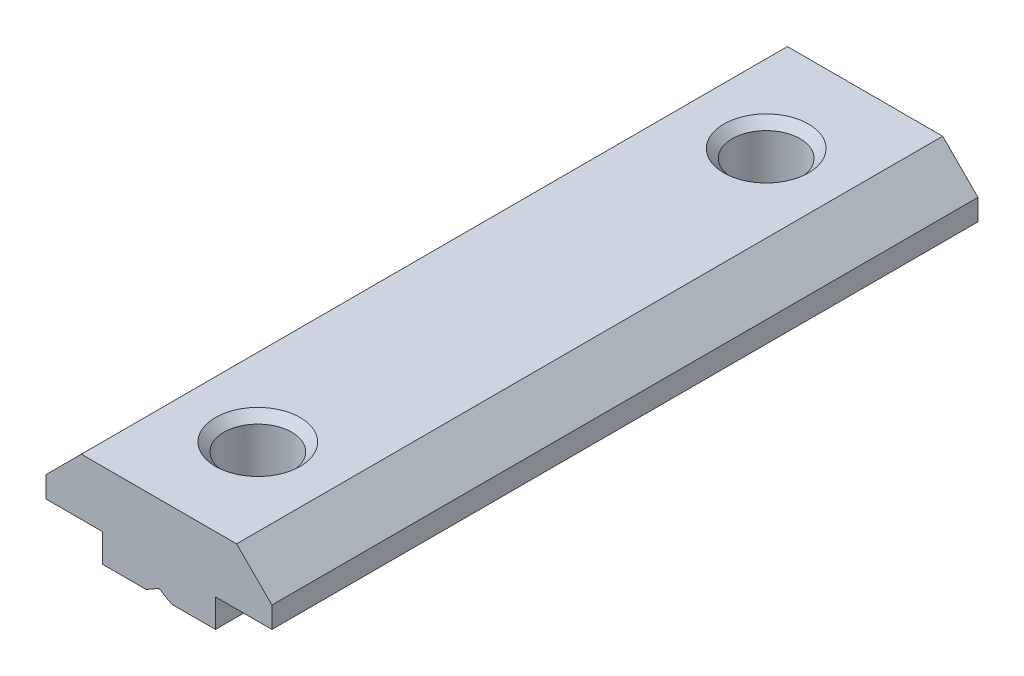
ISO-10303-21;
HEADER;
FILE_DESCRIPTION(('STEP AP214'),'2;1');
FILE_NAME('part.step','',(''),(''),'','','');
FILE_SCHEMA(('AUTOMOTIVE_DESIGN { 1 0 10303 214 1 1 1 1 }'));
ENDSEC;
DATA;
#1=APPLICATION_CONTEXT('core data for automotive mechanical design processes');
#2=APPLICATION_PROTOCOL_DEFINITION('international standard','automotive_design',2000,#1);
#3=PRODUCT_CONTEXT('',#1,'mechanical');
#4=PRODUCT('Part','Part','',(#3));
#5=PRODUCT_RELATED_PRODUCT_CATEGORY('part','',(#4));
#6=PRODUCT_DEFINITION_FORMATION('','',#4);
#7=PRODUCT_DEFINITION_CONTEXT('part definition',#1,'design');
#8=PRODUCT_DEFINITION('design','',#6,#7);
#9=PRODUCT_DEFINITION_SHAPE('','',#8);
#10=(LENGTH_UNIT() NAMED_UNIT(*) SI_UNIT(.MILLI.,.METRE.));
#11=(NAMED_UNIT(*) PLANE_ANGLE_UNIT() SI_UNIT($,.RADIAN.));
#12=(NAMED_UNIT(*) SI_UNIT($,.STERADIAN.) SOLID_ANGLE_UNIT());
#13=UNCERTAINTY_MEASURE_WITH_UNIT(LENGTH_MEASURE(1.E-05),#10,'distance_accuracy_value','');
#14=(GEOMETRIC_REPRESENTATION_CONTEXT(3) GLOBAL_UNCERTAINTY_ASSIGNED_CONTEXT((#13)) GLOBAL_UNIT_ASSIGNED_CONTEXT((#10,
#11,#12)) REPRESENTATION_CONTEXT('',''));
#15=CARTESIAN_POINT('',(0.,0.,0.));
#16=DIRECTION('',(0.,0.,1.));
#17=DIRECTION('',(1.,0.,0.));
#18=AXIS2_PLACEMENT_3D('',#15,#16,#17);
#19=CARTESIAN_POINT('',(0.7,0.45980762,-25.));
#20=DIRECTION('',(-0.49999999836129,-0.866025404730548,0.));
#21=DIRECTION('',(0.866025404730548,-0.49999999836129,0.));
#22=AXIS2_PLACEMENT_3D('',#19,#20,#21);
#23=PLANE('',#22);
#24=CARTESIAN_POINT('',(2.3980761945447,-0.520577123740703,-18.));
#25=DIRECTION('',(-0.49999999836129,-0.866025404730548,0.));
#26=DIRECTION('',(0.866025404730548,-0.49999999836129,0.));
#27=AXIS2_PLACEMENT_3D('',#24,#25,#26);
#28=ELLIPSE('',#27,4.2961524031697,3.03783850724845);
#29=CARTESIAN_POINT('',(0.25,0.71961524,-15.5196152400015));
#30=VERTEX_POINT('',#29);
#31=CARTESIAN_POINT('',(1.14999999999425,0.200000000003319,-15.1381823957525));
#32=VERTEX_POINT('',#31);
#33=EDGE_CURVE('E159',#30,#32,#28,.F.);
#34=ORIENTED_EDGE('',*,*,#33,.T.);
#35=DIRECTION('',(0.,0.,-1.));
#36=VECTOR('',#35,1.);
#37=CARTESIAN_POINT('',(1.15,0.2,-25.));
#38=LINE('',#37,#36);
#39=CARTESIAN_POINT('',(1.14999999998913,0.200000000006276,15.1381823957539));
#40=VERTEX_POINT('',#39);
#41=EDGE_CURVE('E158',#40,#32,#38,.T.);
#42=ORIENTED_EDGE('',*,*,#41,.F.);
#43=CARTESIAN_POINT('',(2.3980761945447,-0.520577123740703,18.));
#44=DIRECTION('',(-0.49999999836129,-0.866025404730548,0.));
#45=DIRECTION('',(0.866025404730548,-0.49999999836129,0.));
#46=AXIS2_PLACEMENT_3D('',#43,#44,#45);
#47=ELLIPSE('',#46,4.2961524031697,3.03783850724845);
#48=CARTESIAN_POINT('',(0.25,0.71961524,15.5196152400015));
#49=VERTEX_POINT('',#48);
#50=EDGE_CURVE('E19',#40,#49,#47,.F.);
#51=ORIENTED_EDGE('',*,*,#50,.T.);
#52=DIRECTION('',(0.,0.,1.));
#53=VECTOR('',#52,1.);
#54=CARTESIAN_POINT('',(0.25,0.71961524,-25.));
#55=LINE('',#54,#53);
#56=EDGE_CURVE('E180',#30,#49,#55,.T.);
#57=ORIENTED_EDGE('',*,*,#56,.F.);
#58=EDGE_LOOP('',(#34,#42,#51,#57));
#59=FACE_BOUND('',#58,.T.);
#60=ADVANCED_FACE('F16',(#59),#23,.T.);
#61=CARTESIAN_POINT('',(0.7,0.45980762,-25.));
#62=DIRECTION('',(-0.49999999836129,-0.866025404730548,0.));
#63=DIRECTION('',(0.866025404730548,-0.49999999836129,0.));
#64=AXIS2_PLACEMENT_3D('',#61,#62,#63);
#65=PLANE('',#64);
#66=DIRECTION('',(0.866025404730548,-0.49999999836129,0.));
#67=VECTOR('',#66,1.);
#68=CARTESIAN_POINT('',(0.7,0.45980762,-25.));
#69=LINE('',#68,#67);
#70=CARTESIAN_POINT('',(0.25,0.71961524,-25.));
#71=VERTEX_POINT('',#70);
#72=CARTESIAN_POINT('',(1.15,0.2,-25.));
#73=VERTEX_POINT('',#72);
#74=EDGE_CURVE('E245',#71,#73,#69,.T.);
#75=ORIENTED_EDGE('',*,*,#74,.T.);
#76=DIRECTION('',(0.,0.,-1.));
#77=VECTOR('',#76,1.);
#78=CARTESIAN_POINT('',(1.15,0.2,-25.));
#79=LINE('',#78,#77);
#80=CARTESIAN_POINT('',(1.14999999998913,0.200000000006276,-20.8618176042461));
#81=VERTEX_POINT('',#80);
#82=EDGE_CURVE('E297',#81,#73,#79,.T.);
#83=ORIENTED_EDGE('',*,*,#82,.F.);
#84=CARTESIAN_POINT('',(2.3980761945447,-0.520577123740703,-18.));
#85=DIRECTION('',(-0.49999999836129,-0.866025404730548,0.));
#86=DIRECTION('',(0.866025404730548,-0.49999999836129,0.));
#87=AXIS2_PLACEMENT_3D('',#84,#85,#86);
#88=ELLIPSE('',#87,4.2961524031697,3.03783850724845);
#89=CARTESIAN_POINT('',(0.25,0.71961524,-20.4803847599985));
#90=VERTEX_POINT('',#89);
#91=EDGE_CURVE('E186',#81,#90,#88,.F.);
#92=ORIENTED_EDGE('',*,*,#91,.T.);
#93=DIRECTION('',(0.,0.,1.));
#94=VECTOR('',#93,1.);
#95=CARTESIAN_POINT('',(0.25,0.71961524,-25.));
#96=LINE('',#95,#94);
#97=EDGE_CURVE('E188',#71,#90,#96,.T.);
#98=ORIENTED_EDGE('',*,*,#97,.F.);
#99=EDGE_LOOP('',(#75,#83,#92,#98));
#100=FACE_BOUND('',#99,.T.);
#101=ADVANCED_FACE('F380',(#100),#65,.T.);
#102=CARTESIAN_POINT('',(0.7,0.45980762,-25.));
#103=DIRECTION('',(-0.49999999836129,-0.866025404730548,0.));
#104=DIRECTION('',(0.866025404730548,-0.49999999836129,0.));
#105=AXIS2_PLACEMENT_3D('',#102,#103,#104);
#106=PLANE('',#105);
#107=DIRECTION('',(0.866025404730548,-0.49999999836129,0.));
#108=VECTOR('',#107,1.);
#109=CARTESIAN_POINT('',(0.7,0.45980762,25.));
#110=LINE('',#109,#108);
#111=CARTESIAN_POINT('',(1.15,0.2,25.));
#112=VERTEX_POINT('',#111);
#113=CARTESIAN_POINT('',(0.25,0.71961524,25.));
#114=VERTEX_POINT('',#113);
#115=EDGE_CURVE('E155',#112,#114,#110,.F.);
#116=ORIENTED_EDGE('',*,*,#115,.T.);
#117=DIRECTION('',(0.,0.,1.));
#118=VECTOR('',#117,1.);
#119=CARTESIAN_POINT('',(0.25,0.71961524,-25.));
#120=LINE('',#119,#118);
#121=CARTESIAN_POINT('',(0.25,0.71961524,20.4803847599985));
#122=VERTEX_POINT('',#121);
#123=EDGE_CURVE('E191',#122,#114,#120,.T.);
#124=ORIENTED_EDGE('',*,*,#123,.F.);
#125=CARTESIAN_POINT('',(2.3980761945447,-0.520577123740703,18.));
#126=DIRECTION('',(-0.49999999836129,-0.866025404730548,0.));
#127=DIRECTION('',(0.866025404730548,-0.49999999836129,0.));
#128=AXIS2_PLACEMENT_3D('',#125,#126,#127);
#129=ELLIPSE('',#128,4.2961524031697,3.03783850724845);
#130=CARTESIAN_POINT('',(1.14999999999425,0.200000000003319,20.8618176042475));
#131=VERTEX_POINT('',#130);
#132=EDGE_CURVE('E154',#122,#131,#129,.F.);
#133=ORIENTED_EDGE('',*,*,#132,.T.);
#134=DIRECTION('',(0.,0.,-1.));
#135=VECTOR('',#134,1.);
#136=CARTESIAN_POINT('',(1.15,0.2,-25.));
#137=LINE('',#136,#135);
#138=EDGE_CURVE('E168',#112,#131,#137,.T.);
#139=ORIENTED_EDGE('',*,*,#138,.F.);
#140=EDGE_LOOP('',(#116,#124,#133,#139));
#141=FACE_BOUND('',#140,.T.);
#142=ADVANCED_FACE('F194',(#141),#106,.T.);
#143=CARTESIAN_POINT('',(0.25,0.200000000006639,18.));
#144=DIRECTION('',(0.,-1.,0.));
#145=DIRECTION('',(0.,0.,-1.));
#146=AXIS2_PLACEMENT_3D('',#143,#144,#145);
#147=CONICAL_SURFACE('',#146,2.99999999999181,0.785398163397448);
#148=CARTESIAN_POINT('',(0.25,0.8,18.));
#149=DIRECTION('',(0.,-1.,0.));
#150=DIRECTION('',(0.,0.,-1.));
#151=AXIS2_PLACEMENT_3D('',#148,#149,#150);
#152=CIRCLE('',#151,2.4);
#153=CARTESIAN_POINT('',(0.25,0.8,15.6));
#154=VERTEX_POINT('',#153);
#155=EDGE_CURVE('E229',#154,#154,#152,.F.);
#156=ORIENTED_EDGE('',*,*,#155,.T.);
#157=EDGE_LOOP('',(#156));
#158=FACE_BOUND('',#157,.T.);
#159=CARTESIAN_POINT('',(0.25,0.200000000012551,18.));
#160=DIRECTION('',(0.,-1.,0.));
#161=DIRECTION('',(0.,0.,-1.));
#162=AXIS2_PLACEMENT_3D('',#159,#160,#161);
#163=CIRCLE('',#162,2.9999999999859);
#164=EDGE_CURVE('E147',#131,#40,#163,.F.);
#165=ORIENTED_EDGE('',*,*,#164,.F.);
#166=ORIENTED_EDGE('',*,*,#132,.F.);
#167=CARTESIAN_POINT('',(-1.8980761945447,-0.520577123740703,18.));
#168=DIRECTION('',(0.49999999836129,-0.866025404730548,0.));
#169=DIRECTION('',(-0.866025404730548,-0.49999999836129,0.));
#170=AXIS2_PLACEMENT_3D('',#167,#168,#169);
#171=ELLIPSE('',#170,4.2961524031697,3.03783850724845);
#172=CARTESIAN_POINT('',(-0.64999999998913,0.200000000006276,20.8618176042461));
#173=VERTEX_POINT('',#172);
#174=EDGE_CURVE('E189',#173,#122,#171,.F.);
#175=ORIENTED_EDGE('',*,*,#174,.F.);
#176=CARTESIAN_POINT('',(0.25,0.200000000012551,18.));
#177=DIRECTION('',(0.,-1.,0.));
#178=DIRECTION('',(0.,0.,-1.));
#179=AXIS2_PLACEMENT_3D('',#176,#177,#178);
#180=CIRCLE('',#179,2.9999999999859);
#181=CARTESIAN_POINT('',(-0.649999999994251,0.200000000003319,15.1381823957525));
#182=VERTEX_POINT('',#181);
#183=EDGE_CURVE('E198',#182,#173,#180,.F.);
#184=ORIENTED_EDGE('',*,*,#183,.F.);
#185=CARTESIAN_POINT('',(-1.8980761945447,-0.520577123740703,18.));
#186=DIRECTION('',(0.49999999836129,-0.866025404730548,0.));
#187=DIRECTION('',(-0.866025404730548,-0.49999999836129,0.));
#188=AXIS2_PLACEMENT_3D('',#185,#186,#187);
#189=ELLIPSE('',#188,4.2961524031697,3.03783850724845);
#190=EDGE_CURVE('E150',#49,#182,#189,.F.);
#191=ORIENTED_EDGE('',*,*,#190,.F.);
#192=ORIENTED_EDGE('',*,*,#50,.F.);
#193=EDGE_LOOP('',(#165,#166,#175,#184,#191,#192));
#194=FACE_BOUND('',#193,.T.);
#195=ADVANCED_FACE('F145',(#158,#194),#147,.F.);
#196=CARTESIAN_POINT('',(-0.2,0.45980762,-25.));
#197=DIRECTION('',(0.49999999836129,-0.866025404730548,0.));
#198=DIRECTION('',(0.866025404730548,0.49999999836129,0.));
#199=AXIS2_PLACEMENT_3D('',#196,#197,#198);
#200=PLANE('',#199);
#201=DIRECTION('',(0.866025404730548,0.49999999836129,0.));
#202=VECTOR('',#201,1.);
#203=CARTESIAN_POINT('',(-0.2,0.45980762,25.));
#204=LINE('',#203,#202);
#205=CARTESIAN_POINT('',(-0.65,0.2,25.));
#206=VERTEX_POINT('',#205);
#207=EDGE_CURVE('E204',#114,#206,#204,.F.);
#208=ORIENTED_EDGE('',*,*,#207,.T.);
#209=DIRECTION('',(0.,0.,-1.));
#210=VECTOR('',#209,1.);
#211=CARTESIAN_POINT('',(-0.65,0.2,-25.));
#212=LINE('',#211,#210);
#213=EDGE_CURVE('E201',#173,#206,#212,.F.);
#214=ORIENTED_EDGE('',*,*,#213,.F.);
#215=ORIENTED_EDGE('',*,*,#174,.T.);
#216=ORIENTED_EDGE('',*,*,#123,.T.);
#217=EDGE_LOOP('',(#208,#214,#215,#216));
#218=FACE_BOUND('',#217,.T.);
#219=ADVANCED_FACE('F202',(#218),#200,.T.);
#220=CARTESIAN_POINT('',(-0.2,0.45980762,-25.));
#221=DIRECTION('',(0.49999999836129,-0.866025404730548,0.));
#222=DIRECTION('',(0.866025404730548,0.49999999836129,0.));
#223=AXIS2_PLACEMENT_3D('',#220,#221,#222);
#224=PLANE('',#223);
#225=DIRECTION('',(0.866025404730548,0.49999999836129,0.));
#226=VECTOR('',#225,1.);
#227=CARTESIAN_POINT('',(-0.2,0.45980762,-25.));
#228=LINE('',#227,#226);
#229=CARTESIAN_POINT('',(-0.65,0.2,-25.));
#230=VERTEX_POINT('',#229);
#231=EDGE_CURVE('E263',#230,#71,#228,.T.);
#232=ORIENTED_EDGE('',*,*,#231,.T.);
#233=ORIENTED_EDGE('',*,*,#97,.T.);
#234=CARTESIAN_POINT('',(-1.8980761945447,-0.520577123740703,-18.));
#235=DIRECTION('',(0.49999999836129,-0.866025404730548,0.));
#236=DIRECTION('',(-0.866025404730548,-0.49999999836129,0.));
#237=AXIS2_PLACEMENT_3D('',#234,#235,#236);
#238=ELLIPSE('',#237,4.2961524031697,3.03783850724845);
#239=CARTESIAN_POINT('',(-0.649999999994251,0.200000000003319,-20.8618176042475));
#240=VERTEX_POINT('',#239);
#241=EDGE_CURVE('E183',#90,#240,#238,.F.);
#242=ORIENTED_EDGE('',*,*,#241,.T.);
#243=DIRECTION('',(0.,0.,-1.));
#244=VECTOR('',#243,1.);
#245=CARTESIAN_POINT('',(-0.65,0.2,-25.));
#246=LINE('',#245,#244);
#247=EDGE_CURVE('E220',#230,#240,#246,.F.);
#248=ORIENTED_EDGE('',*,*,#247,.F.);
#249=EDGE_LOOP('',(#232,#233,#242,#248));
#250=FACE_BOUND('',#249,.T.);
#251=ADVANCED_FACE('F385',(#250),#224,.T.);
#252=CARTESIAN_POINT('',(0.25,0.200000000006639,-18.));
#253=DIRECTION('',(0.,-1.,0.));
#254=DIRECTION('',(0.,0.,-1.));
#255=AXIS2_PLACEMENT_3D('',#252,#253,#254);
#256=CONICAL_SURFACE('',#255,2.99999999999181,0.785398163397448);
#257=CARTESIAN_POINT('',(0.25,0.8,-18.));
#258=DIRECTION('',(0.,-1.,0.));
#259=DIRECTION('',(0.,0.,-1.));
#260=AXIS2_PLACEMENT_3D('',#257,#258,#259);
#261=CIRCLE('',#260,2.4);
#262=CARTESIAN_POINT('',(0.25,0.8,-20.4));
#263=VERTEX_POINT('',#262);
#264=EDGE_CURVE('E232',#263,#263,#261,.F.);
#265=ORIENTED_EDGE('',*,*,#264,.T.);
#266=EDGE_LOOP('',(#265));
#267=FACE_BOUND('',#266,.T.);
#268=CARTESIAN_POINT('',(0.25,0.200000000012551,-18.));
#269=DIRECTION('',(0.,-1.,0.));
#270=DIRECTION('',(0.,0.,-1.));
#271=AXIS2_PLACEMENT_3D('',#268,#269,#270);
#272=CIRCLE('',#271,2.9999999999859);
#273=EDGE_CURVE('E162',#32,#81,#272,.F.);
#274=ORIENTED_EDGE('',*,*,#273,.F.);
#275=ORIENTED_EDGE('',*,*,#33,.F.);
#276=CARTESIAN_POINT('',(-1.8980761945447,-0.520577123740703,-18.));
#277=DIRECTION('',(0.49999999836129,-0.866025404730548,0.));
#278=DIRECTION('',(-0.866025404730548,-0.49999999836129,0.));
#279=AXIS2_PLACEMENT_3D('',#276,#277,#278);
#280=ELLIPSE('',#279,4.2961524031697,3.03783850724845);
#281=CARTESIAN_POINT('',(-0.64999999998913,0.200000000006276,-15.1381823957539));
#282=VERTEX_POINT('',#281);
#283=EDGE_CURVE('E177',#282,#30,#280,.F.);
#284=ORIENTED_EDGE('',*,*,#283,.F.);
#285=CARTESIAN_POINT('',(0.25,0.200000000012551,-18.));
#286=DIRECTION('',(0.,-1.,0.));
#287=DIRECTION('',(0.,0.,-1.));
#288=AXIS2_PLACEMENT_3D('',#285,#286,#287);
#289=CIRCLE('',#288,2.9999999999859);
#290=EDGE_CURVE('E218',#240,#282,#289,.F.);
#291=ORIENTED_EDGE('',*,*,#290,.F.);
#292=ORIENTED_EDGE('',*,*,#241,.F.);
#293=ORIENTED_EDGE('',*,*,#91,.F.);
#294=EDGE_LOOP('',(#274,#275,#284,#291,#292,#293));
#295=FACE_BOUND('',#294,.T.);
#296=ADVANCED_FACE('F551',(#267,#295),#256,.F.);
#297=CARTESIAN_POINT('',(-0.2,0.45980762,-25.));
#298=DIRECTION('',(0.49999999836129,-0.866025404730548,0.));
#299=DIRECTION('',(0.866025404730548,0.49999999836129,0.));
#300=AXIS2_PLACEMENT_3D('',#297,#298,#299);
#301=PLANE('',#300);
#302=ORIENTED_EDGE('',*,*,#283,.T.);
#303=ORIENTED_EDGE('',*,*,#56,.T.);
#304=ORIENTED_EDGE('',*,*,#190,.T.);
#305=DIRECTION('',(0.,0.,-1.));
#306=VECTOR('',#305,1.);
#307=CARTESIAN_POINT('',(-0.650000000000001,0.2,-25.));
#308=LINE('',#307,#306);
#309=EDGE_CURVE('E214',#282,#182,#308,.F.);
#310=ORIENTED_EDGE('',*,*,#309,.F.);
#311=EDGE_LOOP('',(#302,#303,#304,#310));
#312=FACE_BOUND('',#311,.T.);
#313=ADVANCED_FACE('F542',(#312),#301,.T.);
#314=CARTESIAN_POINT('',(0.25,3.2,18.));
#315=DIRECTION('',(0.,-1.,0.));
#316=DIRECTION('',(0.,0.,-1.));
#317=AXIS2_PLACEMENT_3D('',#314,#315,#316);
#318=CYLINDRICAL_SURFACE('',#317,2.4);
#319=CARTESIAN_POINT('',(0.25,5.60000000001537,18.));
#320=DIRECTION('',(0.,1.,0.));
#321=DIRECTION('',(-1.,0.,0.));
#322=AXIS2_PLACEMENT_3D('',#319,#320,#321);
#323=CIRCLE('',#322,2.3999999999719);
#324=CARTESIAN_POINT('',(-2.1499999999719,5.60000000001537,18.));
#325=VERTEX_POINT('',#324);
#326=EDGE_CURVE('E281',#325,#325,#323,.T.);
#327=ORIENTED_EDGE('',*,*,#326,.T.);
#328=EDGE_LOOP('',(#327));
#329=FACE_BOUND('',#328,.T.);
#330=ORIENTED_EDGE('',*,*,#155,.F.);
#331=EDGE_LOOP('',(#330));
#332=FACE_BOUND('',#331,.T.);
#333=ADVANCED_FACE('F533',(#329,#332),#318,.F.);
#334=CARTESIAN_POINT('',(0.25,3.2,-18.));
#335=DIRECTION('',(0.,-1.,0.));
#336=DIRECTION('',(0.,0.,-1.));
#337=AXIS2_PLACEMENT_3D('',#334,#335,#336);
#338=CYLINDRICAL_SURFACE('',#337,2.4);
#339=CARTESIAN_POINT('',(0.25,5.60000000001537,-18.));
#340=DIRECTION('',(0.,1.,0.));
#341=DIRECTION('',(-1.,0.,0.));
#342=AXIS2_PLACEMENT_3D('',#339,#340,#341);
#343=CIRCLE('',#342,2.3999999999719);
#344=CARTESIAN_POINT('',(-2.1499999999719,5.60000000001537,-18.));
#345=VERTEX_POINT('',#344);
#346=EDGE_CURVE('E284',#345,#345,#343,.T.);
#347=ORIENTED_EDGE('',*,*,#346,.T.);
#348=EDGE_LOOP('',(#347));
#349=FACE_BOUND('',#348,.T.);
#350=ORIENTED_EDGE('',*,*,#264,.F.);
#351=EDGE_LOOP('',(#350));
#352=FACE_BOUND('',#351,.T.);
#353=ADVANCED_FACE('F525',(#349,#352),#338,.F.);
#354=CARTESIAN_POINT('',(8.25,2.95,-25.));
#355=DIRECTION('',(1.,0.,0.));
#356=DIRECTION('',(0.,0.,-1.));
#357=AXIS2_PLACEMENT_3D('',#354,#355,#356);
#358=PLANE('',#357);
#359=DIRECTION('',(0.,1.,0.));
#360=VECTOR('',#359,1.);
#361=CARTESIAN_POINT('',(8.25,2.95,-25.));
#362=LINE('',#361,#360);
#363=CARTESIAN_POINT('',(8.25,2.2,-25.));
#364=VERTEX_POINT('',#363);
#365=CARTESIAN_POINT('',(8.25,3.7,-25.));
#366=VERTEX_POINT('',#365);
#367=EDGE_CURVE('E235',#364,#366,#362,.T.);
#368=ORIENTED_EDGE('',*,*,#367,.T.);
#369=DIRECTION('',(0.,0.,1.));
#370=VECTOR('',#369,1.);
#371=CARTESIAN_POINT('',(8.25,3.7,-25.));
#372=LINE('',#371,#370);
#373=CARTESIAN_POINT('',(8.25,3.7,25.));
#374=VERTEX_POINT('',#373);
#375=EDGE_CURVE('E327',#374,#366,#372,.F.);
#376=ORIENTED_EDGE('',*,*,#375,.F.);
#377=DIRECTION('',(0.,1.,0.));
#378=VECTOR('',#377,1.);
#379=CARTESIAN_POINT('',(8.25,3.30469250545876,25.));
#380=LINE('',#379,#378);
#381=CARTESIAN_POINT('',(8.25,2.2,25.));
#382=VERTEX_POINT('',#381);
#383=EDGE_CURVE('E315',#374,#382,#380,.F.);
#384=ORIENTED_EDGE('',*,*,#383,.T.);
#385=DIRECTION('',(0.,0.,-1.));
#386=VECTOR('',#385,1.);
#387=CARTESIAN_POINT('',(8.25,2.2,-25.));
#388=LINE('',#387,#386);
#389=EDGE_CURVE('E172',#364,#382,#388,.F.);
#390=ORIENTED_EDGE('',*,*,#389,.F.);
#391=EDGE_LOOP('',(#368,#376,#384,#390));
#392=FACE_BOUND('',#391,.T.);
#393=ADVANCED_FACE('F367',(#392),#358,.T.);
#394=CARTESIAN_POINT('',(-3.75,1.2,-25.));
#395=DIRECTION('',(-1.,0.,0.));
#396=DIRECTION('',(0.,0.,1.));
#397=AXIS2_PLACEMENT_3D('',#394,#395,#396);
#398=PLANE('',#397);
#399=DIRECTION('',(0.,1.,0.));
#400=VECTOR('',#399,1.);
#401=CARTESIAN_POINT('',(-3.75,3.30469250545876,-25.));
#402=LINE('',#401,#400);
#403=CARTESIAN_POINT('',(-3.75,0.2,-25.));
#404=VERTEX_POINT('',#403);
#405=CARTESIAN_POINT('',(-3.75,2.2,-25.));
#406=VERTEX_POINT('',#405);
#407=EDGE_CURVE('E330',#404,#406,#402,.T.);
#408=ORIENTED_EDGE('',*,*,#407,.F.);
#409=DIRECTION('',(0.,0.,-1.));
#410=VECTOR('',#409,1.);
#411=CARTESIAN_POINT('',(-3.75,0.2,-25.));
#412=LINE('',#411,#410);
#413=CARTESIAN_POINT('',(-3.75,0.2,25.));
#414=VERTEX_POINT('',#413);
#415=EDGE_CURVE('E208',#414,#404,#412,.T.);
#416=ORIENTED_EDGE('',*,*,#415,.F.);
#417=DIRECTION('',(0.,1.,0.));
#418=VECTOR('',#417,1.);
#419=CARTESIAN_POINT('',(-3.75,3.30469250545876,25.));
#420=LINE('',#419,#418);
#421=CARTESIAN_POINT('',(-3.75,2.2,25.));
#422=VERTEX_POINT('',#421);
#423=EDGE_CURVE('E259',#414,#422,#420,.T.);
#424=ORIENTED_EDGE('',*,*,#423,.T.);
#425=DIRECTION('',(0.,0.,-1.));
#426=VECTOR('',#425,1.);
#427=CARTESIAN_POINT('',(-3.75,2.2,-25.));
#428=LINE('',#427,#426);
#429=EDGE_CURVE('E290',#406,#422,#428,.F.);
#430=ORIENTED_EDGE('',*,*,#429,.F.);
#431=EDGE_LOOP('',(#408,#416,#424,#430));
#432=FACE_BOUND('',#431,.T.);
#433=ADVANCED_FACE('F389',(#432),#398,.T.);
#434=CARTESIAN_POINT('',(-5.75,2.2,-25.));
#435=DIRECTION('',(0.,-1.,0.));
#436=DIRECTION('',(0.,0.,-1.));
#437=AXIS2_PLACEMENT_3D('',#434,#435,#436);
#438=PLANE('',#437);
#439=DIRECTION('',(-1.,0.,0.));
#440=VECTOR('',#439,1.);
#441=CARTESIAN_POINT('',(0.25,2.2,-25.));
#442=LINE('',#441,#440);
#443=CARTESIAN_POINT('',(-7.75,2.2,-25.));
#444=VERTEX_POINT('',#443);
#445=EDGE_CURVE('E333',#406,#444,#442,.T.);
#446=ORIENTED_EDGE('',*,*,#445,.F.);
#447=ORIENTED_EDGE('',*,*,#429,.T.);
#448=DIRECTION('',(-1.,0.,0.));
#449=VECTOR('',#448,1.);
#450=CARTESIAN_POINT('',(0.25,2.2,25.));
#451=LINE('',#450,#449);
#452=CARTESIAN_POINT('',(-7.75,2.2,25.));
#453=VERTEX_POINT('',#452);
#454=EDGE_CURVE('E321',#422,#453,#451,.T.);
#455=ORIENTED_EDGE('',*,*,#454,.T.);
#456=DIRECTION('',(0.,0.,1.));
#457=VECTOR('',#456,1.);
#458=CARTESIAN_POINT('',(-7.75,2.2,-25.));
#459=LINE('',#458,#457);
#460=EDGE_CURVE('E285',#444,#453,#459,.T.);
#461=ORIENTED_EDGE('',*,*,#460,.F.);
#462=EDGE_LOOP('',(#446,#447,#455,#461));
#463=FACE_BOUND('',#462,.T.);
#464=ADVANCED_FACE('F394',(#463),#438,.T.);
#465=CARTESIAN_POINT('',(6.25,2.2,-25.));
#466=DIRECTION('',(0.,-1.,0.));
#467=DIRECTION('',(0.,0.,-1.));
#468=AXIS2_PLACEMENT_3D('',#465,#466,#467);
#469=PLANE('',#468);
#470=DIRECTION('',(-1.,0.,0.));
#471=VECTOR('',#470,1.);
#472=CARTESIAN_POINT('',(0.25,2.2,-25.));
#473=LINE('',#472,#471);
#474=CARTESIAN_POINT('',(4.25,2.2,-25.));
#475=VERTEX_POINT('',#474);
#476=EDGE_CURVE('E341',#364,#475,#473,.T.);
#477=ORIENTED_EDGE('',*,*,#476,.F.);
#478=ORIENTED_EDGE('',*,*,#389,.T.);
#479=DIRECTION('',(-1.,0.,0.));
#480=VECTOR('',#479,1.);
#481=CARTESIAN_POINT('',(0.25,2.2,25.));
#482=LINE('',#481,#480);
#483=CARTESIAN_POINT('',(4.25,2.2,25.));
#484=VERTEX_POINT('',#483);
#485=EDGE_CURVE('E317',#382,#484,#482,.T.);
#486=ORIENTED_EDGE('',*,*,#485,.T.);
#487=DIRECTION('',(0.,0.,-1.));
#488=VECTOR('',#487,1.);
#489=CARTESIAN_POINT('',(4.25,2.2,-25.));
#490=LINE('',#489,#488);
#491=EDGE_CURVE('E169',#475,#484,#490,.F.);
#492=ORIENTED_EDGE('',*,*,#491,.F.);
#493=EDGE_LOOP('',(#477,#478,#486,#492));
#494=FACE_BOUND('',#493,.T.);
#495=ADVANCED_FACE('F371',(#494),#469,.T.);
#496=CARTESIAN_POINT('',(4.25,1.2,-25.));
#497=DIRECTION('',(1.,0.,0.));
#498=DIRECTION('',(0.,0.,-1.));
#499=AXIS2_PLACEMENT_3D('',#496,#497,#498);
#500=PLANE('',#499);
#501=DIRECTION('',(0.,1.,0.));
#502=VECTOR('',#501,1.);
#503=CARTESIAN_POINT('',(4.25,3.30469250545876,-25.));
#504=LINE('',#503,#502);
#505=CARTESIAN_POINT('',(4.25,0.2,-25.));
#506=VERTEX_POINT('',#505);
#507=EDGE_CURVE('E242',#475,#506,#504,.F.);
#508=ORIENTED_EDGE('',*,*,#507,.F.);
#509=ORIENTED_EDGE('',*,*,#491,.T.);
#510=DIRECTION('',(0.,1.,0.));
#511=VECTOR('',#510,1.);
#512=CARTESIAN_POINT('',(4.25,3.30469250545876,25.));
#513=LINE('',#512,#511);
#514=CARTESIAN_POINT('',(4.25,0.2,25.));
#515=VERTEX_POINT('',#514);
#516=EDGE_CURVE('E252',#484,#515,#513,.F.);
#517=ORIENTED_EDGE('',*,*,#516,.T.);
#518=DIRECTION('',(0.,0.,-1.));
#519=VECTOR('',#518,1.);
#520=CARTESIAN_POINT('',(4.25,0.2,-25.));
#521=LINE('',#520,#519);
#522=EDGE_CURVE('E215',#506,#515,#521,.F.);
#523=ORIENTED_EDGE('',*,*,#522,.F.);
#524=EDGE_LOOP('',(#508,#509,#517,#523));
#525=FACE_BOUND('',#524,.T.);
#526=ADVANCED_FACE('F375',(#525),#500,.T.);
#527=CARTESIAN_POINT('',(2.7,0.2,-25.));
#528=DIRECTION('',(0.,-1.,0.));
#529=DIRECTION('',(0.,0.,-1.));
#530=AXIS2_PLACEMENT_3D('',#527,#528,#529);
#531=PLANE('',#530);
#532=DIRECTION('',(-1.,0.,0.));
#533=VECTOR('',#532,1.);
#534=CARTESIAN_POINT('',(0.25,0.2,25.));
#535=LINE('',#534,#533);
#536=EDGE_CURVE('E249',#515,#112,#535,.T.);
#537=ORIENTED_EDGE('',*,*,#536,.T.);
#538=ORIENTED_EDGE('',*,*,#138,.T.);
#539=ORIENTED_EDGE('',*,*,#164,.T.);
#540=ORIENTED_EDGE('',*,*,#41,.T.);
#541=ORIENTED_EDGE('',*,*,#273,.T.);
#542=ORIENTED_EDGE('',*,*,#82,.T.);
#543=DIRECTION('',(-1.,0.,0.));
#544=VECTOR('',#543,1.);
#545=CARTESIAN_POINT('',(0.25,0.2,-25.));
#546=LINE('',#545,#544);
#547=EDGE_CURVE('E238',#506,#73,#546,.T.);
#548=ORIENTED_EDGE('',*,*,#547,.F.);
#549=ORIENTED_EDGE('',*,*,#522,.T.);
#550=EDGE_LOOP('',(#537,#538,#539,#540,#541,#542,#548,#549));
#551=FACE_BOUND('',#550,.T.);
#552=ADVANCED_FACE('F166',(#551),#531,.T.);
#553=CARTESIAN_POINT('',(-2.2,0.2,-25.));
#554=DIRECTION('',(0.,-1.,0.));
#555=DIRECTION('',(0.,0.,-1.));
#556=AXIS2_PLACEMENT_3D('',#553,#554,#555);
#557=PLANE('',#556);
#558=ORIENTED_EDGE('',*,*,#290,.T.);
#559=ORIENTED_EDGE('',*,*,#309,.T.);
#560=ORIENTED_EDGE('',*,*,#183,.T.);
#561=ORIENTED_EDGE('',*,*,#213,.T.);
#562=DIRECTION('',(-1.,0.,0.));
#563=VECTOR('',#562,1.);
#564=CARTESIAN_POINT('',(0.25,0.2,25.));
#565=LINE('',#564,#563);
#566=EDGE_CURVE('E251',#206,#414,#565,.T.);
#567=ORIENTED_EDGE('',*,*,#566,.T.);
#568=ORIENTED_EDGE('',*,*,#415,.T.);
#569=DIRECTION('',(-1.,0.,0.));
#570=VECTOR('',#569,1.);
#571=CARTESIAN_POINT('',(0.25,0.2,-25.));
#572=LINE('',#571,#570);
#573=EDGE_CURVE('E241',#230,#404,#572,.T.);
#574=ORIENTED_EDGE('',*,*,#573,.F.);
#575=ORIENTED_EDGE('',*,*,#247,.T.);
#576=EDGE_LOOP('',(#558,#559,#560,#561,#567,#568,#574,#575));
#577=FACE_BOUND('',#576,.T.);
#578=ADVANCED_FACE('F212',(#577),#557,.T.);
#579=CARTESIAN_POINT('',(-7.75,2.95,-25.));
#580=DIRECTION('',(-1.,0.,0.));
#581=DIRECTION('',(0.,0.,1.));
#582=AXIS2_PLACEMENT_3D('',#579,#580,#581);
#583=PLANE('',#582);
#584=DIRECTION('',(0.,1.,0.));
#585=VECTOR('',#584,1.);
#586=CARTESIAN_POINT('',(-7.75,3.30469250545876,-25.));
#587=LINE('',#586,#585);
#588=CARTESIAN_POINT('',(-7.75,3.7,-25.));
#589=VERTEX_POINT('',#588);
#590=EDGE_CURVE('E336',#444,#589,#587,.T.);
#591=ORIENTED_EDGE('',*,*,#590,.F.);
#592=ORIENTED_EDGE('',*,*,#460,.T.);
#593=DIRECTION('',(0.,1.,0.));
#594=VECTOR('',#593,1.);
#595=CARTESIAN_POINT('',(-7.75,3.30469250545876,25.));
#596=LINE('',#595,#594);
#597=CARTESIAN_POINT('',(-7.75,3.7,25.));
#598=VERTEX_POINT('',#597);
#599=EDGE_CURVE('E288',#453,#598,#596,.T.);
#600=ORIENTED_EDGE('',*,*,#599,.T.);
#601=DIRECTION('',(0.,0.,1.));
#602=VECTOR('',#601,1.);
#603=CARTESIAN_POINT('',(-7.75,3.7,-25.));
#604=LINE('',#603,#602);
#605=EDGE_CURVE('E225',#589,#598,#604,.T.);
#606=ORIENTED_EDGE('',*,*,#605,.F.);
#607=EDGE_LOOP('',(#591,#592,#600,#606));
#608=FACE_BOUND('',#607,.T.);
#609=ADVANCED_FACE('F398',(#608),#583,.T.);
#610=CARTESIAN_POINT('',(0.25,6.20000000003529,18.));
#611=DIRECTION('',(0.,1.,0.));
#612=DIRECTION('',(0.,0.,1.));
#613=AXIS2_PLACEMENT_3D('',#610,#611,#612);
#614=CONICAL_SURFACE('',#613,2.99999999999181,0.785398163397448);
#615=CARTESIAN_POINT('',(0.25,6.20000000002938,18.));
#616=DIRECTION('',(0.,1.,0.));
#617=DIRECTION('',(0.,0.,1.));
#618=AXIS2_PLACEMENT_3D('',#615,#616,#617);
#619=CIRCLE('',#618,2.9999999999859);
#620=CARTESIAN_POINT('',(0.25,6.20000000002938,20.9999999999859));
#621=VERTEX_POINT('',#620);
#622=EDGE_CURVE('E221',#621,#621,#619,.F.);
#623=ORIENTED_EDGE('',*,*,#622,.F.);
#624=EDGE_LOOP('',(#623));
#625=FACE_BOUND('',#624,.T.);
#626=ORIENTED_EDGE('',*,*,#326,.F.);
#627=EDGE_LOOP('',(#626));
#628=FACE_BOUND('',#627,.T.);
#629=ADVANCED_FACE('F413',(#625,#628),#614,.F.);
#630=CARTESIAN_POINT('',(0.25,6.20000000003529,-18.));
#631=DIRECTION('',(0.,1.,0.));
#632=DIRECTION('',(0.,0.,1.));
#633=AXIS2_PLACEMENT_3D('',#630,#631,#632);
#634=CONICAL_SURFACE('',#633,2.99999999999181,0.785398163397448);
#635=CARTESIAN_POINT('',(0.25,6.20000000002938,-18.));
#636=DIRECTION('',(0.,1.,0.));
#637=DIRECTION('',(0.,0.,1.));
#638=AXIS2_PLACEMENT_3D('',#635,#636,#637);
#639=CIRCLE('',#638,2.9999999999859);
#640=CARTESIAN_POINT('',(0.25,6.20000000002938,-15.0000000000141));
#641=VERTEX_POINT('',#640);
#642=EDGE_CURVE('E224',#641,#641,#639,.F.);
#643=ORIENTED_EDGE('',*,*,#642,.F.);
#644=EDGE_LOOP('',(#643));
#645=FACE_BOUND('',#644,.T.);
#646=ORIENTED_EDGE('',*,*,#346,.F.);
#647=EDGE_LOOP('',(#646));
#648=FACE_BOUND('',#647,.T.);
#649=ADVANCED_FACE('F405',(#645,#648),#634,.F.);
#650=CARTESIAN_POINT('',(0.25,3.30469250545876,25.));
#651=DIRECTION('',(0.,0.,-1.));
#652=DIRECTION('',(-1.,0.,0.));
#653=AXIS2_PLACEMENT_3D('',#650,#651,#652);
#654=PLANE('',#653);
#655=ORIENTED_EDGE('',*,*,#423,.F.);
#656=ORIENTED_EDGE('',*,*,#566,.F.);
#657=ORIENTED_EDGE('',*,*,#207,.F.);
#658=ORIENTED_EDGE('',*,*,#115,.F.);
#659=ORIENTED_EDGE('',*,*,#536,.F.);
#660=ORIENTED_EDGE('',*,*,#516,.F.);
#661=ORIENTED_EDGE('',*,*,#485,.F.);
#662=ORIENTED_EDGE('',*,*,#383,.F.);
#663=DIRECTION('',(-0.707106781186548,0.707106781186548,0.));
#664=VECTOR('',#663,1.);
#665=CARTESIAN_POINT('',(7.,4.95,25.));
#666=LINE('',#665,#664);
#667=CARTESIAN_POINT('',(5.75,6.2,25.));
#668=VERTEX_POINT('',#667);
#669=EDGE_CURVE('E324',#668,#374,#666,.F.);
#670=ORIENTED_EDGE('',*,*,#669,.F.);
#671=DIRECTION('',(1.,0.,0.));
#672=VECTOR('',#671,1.);
#673=CARTESIAN_POINT('',(0.25,6.2,25.));
#674=LINE('',#673,#672);
#675=CARTESIAN_POINT('',(-5.25,6.2,25.));
#676=VERTEX_POINT('',#675);
#677=EDGE_CURVE('E228',#676,#668,#674,.T.);
#678=ORIENTED_EDGE('',*,*,#677,.F.);
#679=DIRECTION('',(-0.707106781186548,-0.707106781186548,0.));
#680=VECTOR('',#679,1.);
#681=CARTESIAN_POINT('',(-6.5,4.95,25.));
#682=LINE('',#681,#680);
#683=EDGE_CURVE('E271',#598,#676,#682,.F.);
#684=ORIENTED_EDGE('',*,*,#683,.F.);
#685=ORIENTED_EDGE('',*,*,#599,.F.);
#686=ORIENTED_EDGE('',*,*,#454,.F.);
#687=EDGE_LOOP('',(#655,#656,#657,#658,#659,#660,#661,#662,#670,#678,#684,#685,#686));
#688=FACE_BOUND('',#687,.T.);
#689=ADVANCED_FACE('F403',(#688),#654,.F.);
#690=CARTESIAN_POINT('',(7.,4.95,-25.));
#691=DIRECTION('',(0.707106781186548,0.707106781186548,0.));
#692=DIRECTION('',(-0.707106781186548,0.707106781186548,0.));
#693=AXIS2_PLACEMENT_3D('',#690,#691,#692);
#694=PLANE('',#693);
#695=DIRECTION('',(0.707106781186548,-0.707106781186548,0.));
#696=VECTOR('',#695,1.);
#697=CARTESIAN_POINT('',(5.75,6.2,-25.));
#698=LINE('',#697,#696);
#699=CARTESIAN_POINT('',(5.75,6.2,-25.));
#700=VERTEX_POINT('',#699);
#701=EDGE_CURVE('E338',#700,#366,#698,.T.);
#702=ORIENTED_EDGE('',*,*,#701,.F.);
#703=DIRECTION('',(0.,0.,1.));
#704=VECTOR('',#703,1.);
#705=CARTESIAN_POINT('',(5.75,6.2,-25.));
#706=LINE('',#705,#704);
#707=EDGE_CURVE('E353',#668,#700,#706,.F.);
#708=ORIENTED_EDGE('',*,*,#707,.F.);
#709=ORIENTED_EDGE('',*,*,#669,.T.);
#710=ORIENTED_EDGE('',*,*,#375,.T.);
#711=EDGE_LOOP('',(#702,#708,#709,#710));
#712=FACE_BOUND('',#711,.T.);
#713=ADVANCED_FACE('F364',(#712),#694,.T.);
#714=CARTESIAN_POINT('',(0.25,3.30469250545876,-25.));
#715=DIRECTION('',(0.,0.,-1.));
#716=DIRECTION('',(-1.,0.,0.));
#717=AXIS2_PLACEMENT_3D('',#714,#715,#716);
#718=PLANE('',#717);
#719=ORIENTED_EDGE('',*,*,#231,.F.);
#720=ORIENTED_EDGE('',*,*,#573,.T.);
#721=ORIENTED_EDGE('',*,*,#407,.T.);
#722=ORIENTED_EDGE('',*,*,#445,.T.);
#723=ORIENTED_EDGE('',*,*,#590,.T.);
#724=DIRECTION('',(-0.707106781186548,-0.707106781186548,0.));
#725=VECTOR('',#724,1.);
#726=CARTESIAN_POINT('',(-6.5,4.95,-25.));
#727=LINE('',#726,#725);
#728=CARTESIAN_POINT('',(-5.25,6.2,-25.));
#729=VERTEX_POINT('',#728);
#730=EDGE_CURVE('E34',#729,#589,#727,.T.);
#731=ORIENTED_EDGE('',*,*,#730,.F.);
#732=DIRECTION('',(1.,0.,0.));
#733=VECTOR('',#732,1.);
#734=CARTESIAN_POINT('',(0.25,6.2,-25.));
#735=LINE('',#734,#733);
#736=EDGE_CURVE('E25',#700,#729,#735,.F.);
#737=ORIENTED_EDGE('',*,*,#736,.F.);
#738=ORIENTED_EDGE('',*,*,#701,.T.);
#739=ORIENTED_EDGE('',*,*,#367,.F.);
#740=ORIENTED_EDGE('',*,*,#476,.T.);
#741=ORIENTED_EDGE('',*,*,#507,.T.);
#742=ORIENTED_EDGE('',*,*,#547,.T.);
#743=ORIENTED_EDGE('',*,*,#74,.F.);
#744=EDGE_LOOP('',(#719,#720,#721,#722,#723,#731,#737,#738,#739,#740,#741,#742,#743));
#745=FACE_BOUND('',#744,.T.);
#746=ADVANCED_FACE('F361',(#745),#718,.T.);
#747=CARTESIAN_POINT('',(-6.5,4.95,-25.));
#748=DIRECTION('',(-0.707106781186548,0.707106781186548,0.));
#749=DIRECTION('',(-0.707106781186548,-0.707106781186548,0.));
#750=AXIS2_PLACEMENT_3D('',#747,#748,#749);
#751=PLANE('',#750);
#752=ORIENTED_EDGE('',*,*,#730,.T.);
#753=ORIENTED_EDGE('',*,*,#605,.T.);
#754=ORIENTED_EDGE('',*,*,#683,.T.);
#755=DIRECTION('',(0.,0.,1.));
#756=VECTOR('',#755,1.);
#757=CARTESIAN_POINT('',(-5.25,6.2,-25.));
#758=LINE('',#757,#756);
#759=EDGE_CURVE('E10',#729,#676,#758,.T.);
#760=ORIENTED_EDGE('',*,*,#759,.F.);
#761=EDGE_LOOP('',(#752,#753,#754,#760));
#762=FACE_BOUND('',#761,.T.);
#763=ADVANCED_FACE('F401',(#762),#751,.T.);
#764=CARTESIAN_POINT('',(0.25,6.2,-25.));
#765=DIRECTION('',(0.,1.,0.));
#766=DIRECTION('',(0.,0.,1.));
#767=AXIS2_PLACEMENT_3D('',#764,#765,#766);
#768=PLANE('',#767);
#769=ORIENTED_EDGE('',*,*,#736,.T.);
#770=ORIENTED_EDGE('',*,*,#759,.T.);
#771=ORIENTED_EDGE('',*,*,#677,.T.);
#772=ORIENTED_EDGE('',*,*,#707,.T.);
#773=EDGE_LOOP('',(#769,#770,#771,#772));
#774=FACE_BOUND('',#773,.T.);
#775=ORIENTED_EDGE('',*,*,#642,.T.);
#776=EDGE_LOOP('',(#775));
#777=FACE_BOUND('',#776,.T.);
#778=ORIENTED_EDGE('',*,*,#622,.T.);
#779=EDGE_LOOP('',(#778));
#780=FACE_BOUND('',#779,.T.);
#781=ADVANCED_FACE('F358',(#774,#777,#780),#768,.T.);
#782=CLOSED_SHELL('',(#60,#101,#142,#195,#219,#251,#296,#313,#333,#353,#393,#433,#464,#495,#526,
#552,#578,#609,#629,#649,#689,#713,#746,#763,#781));
#783=MANIFOLD_SOLID_BREP('B1',#782);
#784=ADVANCED_BREP_SHAPE_REPRESENTATION('',(#18,#783),#14);
#785=SHAPE_DEFINITION_REPRESENTATION(#9,#784);
ENDSEC;
END-ISO-10303-21;
